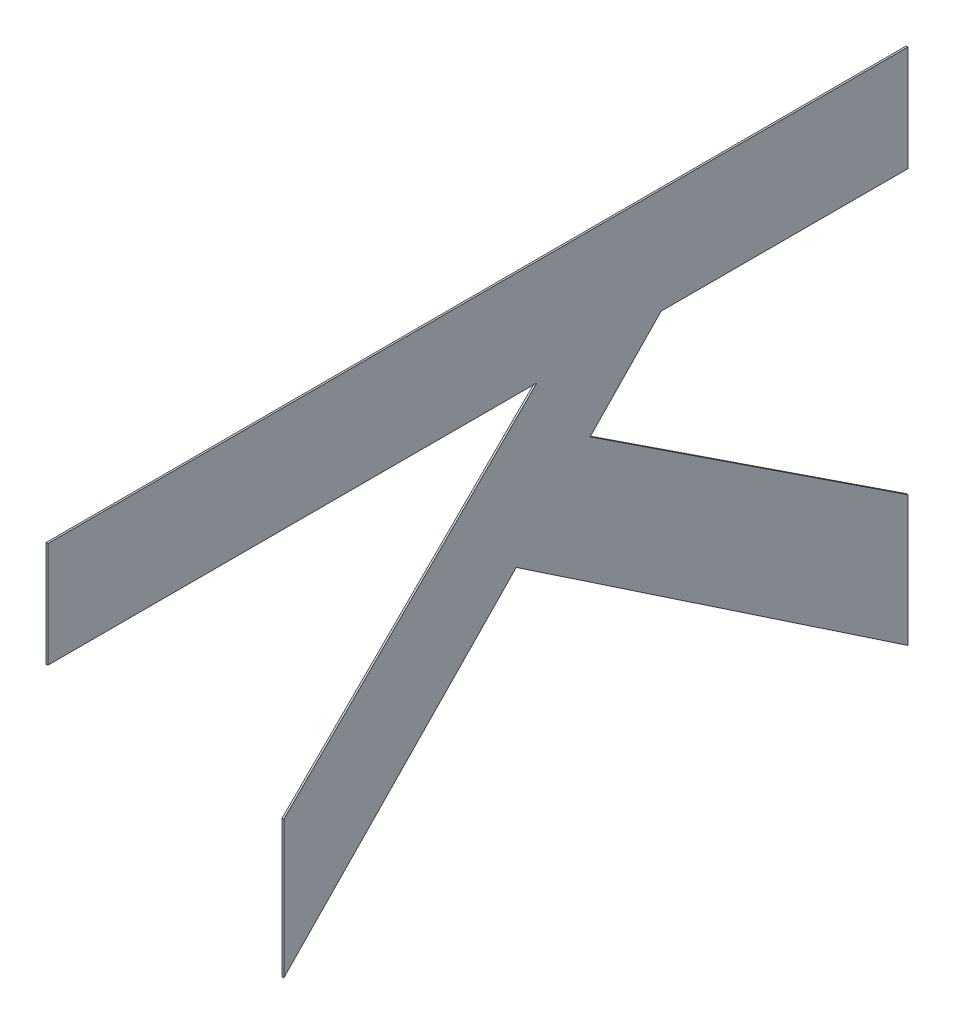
ISO-10303-21;
HEADER;
FILE_DESCRIPTION(('STEP AP214'),'2;1');
FILE_NAME('part.step','',(''),(''),'','','');
FILE_SCHEMA(('AUTOMOTIVE_DESIGN { 1 0 10303 214 1 1 1 1 }'));
ENDSEC;
DATA;
#1=APPLICATION_CONTEXT('core data for automotive mechanical design processes');
#2=APPLICATION_PROTOCOL_DEFINITION('international standard','automotive_design',2000,#1);
#3=PRODUCT_CONTEXT('',#1,'mechanical');
#4=PRODUCT('Part','Part','',(#3));
#5=PRODUCT_RELATED_PRODUCT_CATEGORY('part','',(#4));
#6=PRODUCT_DEFINITION_FORMATION('','',#4);
#7=PRODUCT_DEFINITION_CONTEXT('part definition',#1,'design');
#8=PRODUCT_DEFINITION('design','',#6,#7);
#9=PRODUCT_DEFINITION_SHAPE('','',#8);
#10=(LENGTH_UNIT() NAMED_UNIT(*) SI_UNIT(.MILLI.,.METRE.));
#11=(NAMED_UNIT(*) PLANE_ANGLE_UNIT() SI_UNIT($,.RADIAN.));
#12=(NAMED_UNIT(*) SI_UNIT($,.STERADIAN.) SOLID_ANGLE_UNIT());
#13=UNCERTAINTY_MEASURE_WITH_UNIT(LENGTH_MEASURE(1.E-05),#10,'distance_accuracy_value','');
#14=(GEOMETRIC_REPRESENTATION_CONTEXT(3) GLOBAL_UNCERTAINTY_ASSIGNED_CONTEXT((#13)) GLOBAL_UNIT_ASSIGNED_CONTEXT((#10,
#11,#12)) REPRESENTATION_CONTEXT('',''));
#15=CARTESIAN_POINT('',(0.,0.,0.));
#16=DIRECTION('',(0.,0.,1.));
#17=DIRECTION('',(1.,0.,0.));
#18=AXIS2_PLACEMENT_3D('',#15,#16,#17);
#19=CARTESIAN_POINT('',(-5.56,-7.081189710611,17.19421221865));
#20=DIRECTION('',(-1.,0.,0.));
#21=DIRECTION('',(0.,-1.,0.));
#22=AXIS2_PLACEMENT_3D('',#19,#20,#21);
#23=PLANE('',#22);
#24=DIRECTION('',(0.,1.,0.));
#25=VECTOR('',#24,1.);
#26=CARTESIAN_POINT('',(-5.56,-6.78536977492,22.023794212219));
#27=LINE('',#26,#25);
#28=CARTESIAN_POINT('',(-5.56,-6.78536977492,22.023794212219));
#29=VERTEX_POINT('',#28);
#30=CARTESIAN_POINT('',(-5.56,-7.377009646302,22.023794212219));
#31=VERTEX_POINT('',#30);
#32=EDGE_CURVE('E155',#29,#31,#27,.F.);
#33=ORIENTED_EDGE('',*,*,#32,.F.);
#34=DIRECTION('',(0.,0.,1.));
#35=VECTOR('',#34,1.);
#36=CARTESIAN_POINT('',(-5.56,-6.78536977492,17.19421221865));
#37=LINE('',#36,#35);
#38=CARTESIAN_POINT('',(-5.56,-6.78536977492,17.19421221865));
#39=VERTEX_POINT('',#38);
#40=EDGE_CURVE('E159',#39,#29,#37,.T.);
#41=ORIENTED_EDGE('',*,*,#40,.F.);
#42=DIRECTION('',(0.,-1.,0.));
#43=VECTOR('',#42,1.);
#44=CARTESIAN_POINT('',(-5.56,-7.081189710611,17.19421221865));
#45=LINE('',#44,#43);
#46=CARTESIAN_POINT('',(-5.56,-7.377009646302,17.19421221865));
#47=VERTEX_POINT('',#46);
#48=EDGE_CURVE('E20',#39,#47,#45,.T.);
#49=ORIENTED_EDGE('',*,*,#48,.T.);
#50=DIRECTION('',(0.,0.,1.));
#51=VECTOR('',#50,1.);
#52=CARTESIAN_POINT('',(-5.56,-7.377009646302,18.580064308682));
#53=LINE('',#52,#51);
#54=CARTESIAN_POINT('',(-5.56,-7.37700964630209,18.5800643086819));
#55=VERTEX_POINT('',#54);
#56=EDGE_CURVE('E116',#55,#47,#53,.F.);
#57=ORIENTED_EDGE('',*,*,#56,.F.);
#58=DIRECTION('',(0.,0.718240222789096,-0.695795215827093));
#59=VECTOR('',#58,1.);
#60=CARTESIAN_POINT('',(-5.56,-7.788585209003,18.978778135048));
#61=LINE('',#60,#59);
#62=CARTESIAN_POINT('',(-5.56,-7.7885852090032,18.9787781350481));
#63=VERTEX_POINT('',#62);
#64=EDGE_CURVE('E107',#63,#55,#61,.T.);
#65=ORIENTED_EDGE('',*,*,#64,.F.);
#66=DIRECTION('',(0.,0.549478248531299,0.835508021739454));
#67=VECTOR('',#66,1.);
#68=CARTESIAN_POINT('',(-5.56,-8.962218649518,17.19421221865));
#69=LINE('',#68,#67);
#70=CARTESIAN_POINT('',(-5.56,-8.962218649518,17.19421221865));
#71=VERTEX_POINT('',#70);
#72=EDGE_CURVE('E102',#71,#63,#69,.T.);
#73=ORIENTED_EDGE('',*,*,#72,.F.);
#74=DIRECTION('',(0.,1.,0.));
#75=VECTOR('',#74,1.);
#76=CARTESIAN_POINT('',(-5.56,-9.695337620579,17.19421221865));
#77=LINE('',#76,#75);
#78=CARTESIAN_POINT('',(-5.56,-9.6953376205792,17.1942122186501));
#79=VERTEX_POINT('',#78);
#80=EDGE_CURVE('E131',#79,#71,#77,.T.);
#81=ORIENTED_EDGE('',*,*,#80,.F.);
#82=DIRECTION('',(0.,-0.558055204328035,-0.829803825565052));
#83=VECTOR('',#82,1.);
#84=CARTESIAN_POINT('',(-5.56,-8.216237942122,19.393569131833));
#85=LINE('',#84,#83);
#86=CARTESIAN_POINT('',(-5.56,-8.21623794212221,19.3935691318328));
#87=VERTEX_POINT('',#86);
#88=EDGE_CURVE('E135',#87,#79,#85,.T.);
#89=ORIENTED_EDGE('',*,*,#88,.F.);
#90=DIRECTION('',(0.,0.717328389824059,-0.696735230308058));
#91=VECTOR('',#90,1.);
#92=CARTESIAN_POINT('',(-5.56,-9.560289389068,20.699035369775));
#93=LINE('',#92,#91);
#94=CARTESIAN_POINT('',(-5.56,-9.560289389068,20.699035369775));
#95=VERTEX_POINT('',#94);
#96=EDGE_CURVE('E139',#95,#87,#93,.T.);
#97=ORIENTED_EDGE('',*,*,#96,.F.);
#98=DIRECTION('',(0.,1.,0.));
#99=VECTOR('',#98,1.);
#100=CARTESIAN_POINT('',(-5.56,-8.788585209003,20.699035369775));
#101=LINE('',#100,#99);
#102=CARTESIAN_POINT('',(-5.56,-8.788585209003,20.699035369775));
#103=VERTEX_POINT('',#102);
#104=EDGE_CURVE('E143',#103,#95,#101,.F.);
#105=ORIENTED_EDGE('',*,*,#104,.F.);
#106=DIRECTION('',(0.,-0.704694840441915,0.709510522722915));
#107=VECTOR('',#106,1.);
#108=CARTESIAN_POINT('',(-5.56,-7.377009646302,19.277813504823));
#109=LINE('',#108,#107);
#110=CARTESIAN_POINT('',(-5.56,-7.377009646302,19.277813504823));
#111=VERTEX_POINT('',#110);
#112=EDGE_CURVE('E147',#111,#103,#109,.T.);
#113=ORIENTED_EDGE('',*,*,#112,.F.);
#114=DIRECTION('',(0.,0.,1.));
#115=VECTOR('',#114,1.);
#116=CARTESIAN_POINT('',(-5.56,-7.377009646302,22.023794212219));
#117=LINE('',#116,#115);
#118=EDGE_CURVE('E151',#31,#111,#117,.F.);
#119=ORIENTED_EDGE('',*,*,#118,.F.);
#120=EDGE_LOOP('',(#33,#41,#49,#57,#65,#73,#81,#89,#97,#105,#113,#119));
#121=FACE_BOUND('',#120,.T.);
#122=ADVANCED_FACE('F17',(#121),#23,.T.);
#123=CARTESIAN_POINT('',(-5.56,-7.377009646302,18.580064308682));
#124=DIRECTION('',(0.,-1.,0.));
#125=DIRECTION('',(1.,0.,0.));
#126=AXIS2_PLACEMENT_3D('',#123,#124,#125);
#127=PLANE('',#126);
#128=ORIENTED_EDGE('',*,*,#56,.T.);
#129=DIRECTION('',(-1.,0.,0.));
#130=VECTOR('',#129,1.);
#131=CARTESIAN_POINT('',(-5.56,-7.377009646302,17.19421221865));
#132=LINE('',#131,#130);
#133=CARTESIAN_POINT('',(-5.55,-7.377009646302,17.19421221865));
#134=VERTEX_POINT('',#133);
#135=EDGE_CURVE('E163',#134,#47,#132,.T.);
#136=ORIENTED_EDGE('',*,*,#135,.F.);
#137=DIRECTION('',(0.,0.,1.));
#138=VECTOR('',#137,1.);
#139=CARTESIAN_POINT('',(-5.55,-7.377009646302,17.19421221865));
#140=LINE('',#139,#138);
#141=CARTESIAN_POINT('',(-5.55,-7.37700964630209,18.5800643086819));
#142=VERTEX_POINT('',#141);
#143=EDGE_CURVE('E126',#134,#142,#140,.T.);
#144=ORIENTED_EDGE('',*,*,#143,.T.);
#145=DIRECTION('',(1.,0.,0.));
#146=VECTOR('',#145,1.);
#147=CARTESIAN_POINT('',(-5.56,-7.37700964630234,18.5800643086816));
#148=LINE('',#147,#146);
#149=EDGE_CURVE('E112',#55,#142,#148,.T.);
#150=ORIENTED_EDGE('',*,*,#149,.F.);
#151=EDGE_LOOP('',(#128,#136,#144,#150));
#152=FACE_BOUND('',#151,.T.);
#153=ADVANCED_FACE('F125',(#152),#127,.T.);
#154=CARTESIAN_POINT('',(-5.56,-7.788585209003,18.978778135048));
#155=DIRECTION('',(0.,-0.695795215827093,-0.718240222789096));
#156=DIRECTION('',(0.,0.718240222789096,-0.695795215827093));
#157=AXIS2_PLACEMENT_3D('',#154,#155,#156);
#158=PLANE('',#157);
#159=ORIENTED_EDGE('',*,*,#64,.T.);
#160=ORIENTED_EDGE('',*,*,#149,.T.);
#161=DIRECTION('',(0.,-0.718240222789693,0.695795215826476));
#162=VECTOR('',#161,1.);
#163=CARTESIAN_POINT('',(-5.55,-7.377009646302,18.580064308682));
#164=LINE('',#163,#162);
#165=CARTESIAN_POINT('',(-5.55,-7.7885852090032,18.9787781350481));
#166=VERTEX_POINT('',#165);
#167=EDGE_CURVE('E167',#142,#166,#164,.T.);
#168=ORIENTED_EDGE('',*,*,#167,.T.);
#169=DIRECTION('',(1.,0.,0.));
#170=VECTOR('',#169,1.);
#171=CARTESIAN_POINT('',(-5.56,-7.78858520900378,18.9787781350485));
#172=LINE('',#171,#170);
#173=EDGE_CURVE('E114',#63,#166,#172,.T.);
#174=ORIENTED_EDGE('',*,*,#173,.F.);
#175=EDGE_LOOP('',(#159,#160,#168,#174));
#176=FACE_BOUND('',#175,.T.);
#177=ADVANCED_FACE('F109',(#176),#158,.T.);
#178=CARTESIAN_POINT('',(-5.56,-8.962218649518,17.19421221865));
#179=DIRECTION('',(0.,0.835508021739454,-0.549478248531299));
#180=DIRECTION('',(0.,0.549478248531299,0.835508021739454));
#181=AXIS2_PLACEMENT_3D('',#178,#179,#180);
#182=PLANE('',#181);
#183=ORIENTED_EDGE('',*,*,#72,.T.);
#184=ORIENTED_EDGE('',*,*,#173,.T.);
#185=DIRECTION('',(0.,-0.549478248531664,-0.835508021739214));
#186=VECTOR('',#185,1.);
#187=CARTESIAN_POINT('',(-5.55,-7.788585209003,18.978778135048));
#188=LINE('',#187,#186);
#189=CARTESIAN_POINT('',(-5.55,-8.962218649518,17.19421221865));
#190=VERTEX_POINT('',#189);
#191=EDGE_CURVE('E169',#166,#190,#188,.T.);
#192=ORIENTED_EDGE('',*,*,#191,.T.);
#193=DIRECTION('',(-1.,0.,0.));
#194=VECTOR('',#193,1.);
#195=CARTESIAN_POINT('',(-5.56,-8.962218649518,17.19421221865));
#196=LINE('',#195,#194);
#197=EDGE_CURVE('E133',#71,#190,#196,.F.);
#198=ORIENTED_EDGE('',*,*,#197,.F.);
#199=EDGE_LOOP('',(#183,#184,#192,#198));
#200=FACE_BOUND('',#199,.T.);
#201=ADVANCED_FACE('F234',(#200),#182,.T.);
#202=CARTESIAN_POINT('',(-5.56,-9.695337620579,17.19421221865));
#203=DIRECTION('',(0.,0.,-1.));
#204=DIRECTION('',(-1.,0.,0.));
#205=AXIS2_PLACEMENT_3D('',#202,#203,#204);
#206=PLANE('',#205);
#207=ORIENTED_EDGE('',*,*,#80,.T.);
#208=ORIENTED_EDGE('',*,*,#197,.T.);
#209=DIRECTION('',(0.,-1.,0.));
#210=VECTOR('',#209,1.);
#211=CARTESIAN_POINT('',(-5.55,-7.081189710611,17.19421221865));
#212=LINE('',#211,#210);
#213=CARTESIAN_POINT('',(-5.55,-9.6953376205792,17.1942122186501));
#214=VERTEX_POINT('',#213);
#215=EDGE_CURVE('E172',#190,#214,#212,.T.);
#216=ORIENTED_EDGE('',*,*,#215,.T.);
#217=DIRECTION('',(1.,0.,0.));
#218=VECTOR('',#217,1.);
#219=CARTESIAN_POINT('',(-5.56,-9.6953376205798,17.1942122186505));
#220=LINE('',#219,#218);
#221=EDGE_CURVE('E137',#79,#214,#220,.T.);
#222=ORIENTED_EDGE('',*,*,#221,.F.);
#223=EDGE_LOOP('',(#207,#208,#216,#222));
#224=FACE_BOUND('',#223,.T.);
#225=ADVANCED_FACE('F233',(#224),#206,.T.);
#226=CARTESIAN_POINT('',(-5.56,-8.216237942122,19.393569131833));
#227=DIRECTION('',(0.,-0.829803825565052,0.558055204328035));
#228=DIRECTION('',(0.,-0.558055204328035,-0.829803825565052));
#229=AXIS2_PLACEMENT_3D('',#226,#227,#228);
#230=PLANE('',#229);
#231=ORIENTED_EDGE('',*,*,#88,.T.);
#232=ORIENTED_EDGE('',*,*,#221,.T.);
#233=DIRECTION('',(0.,0.558055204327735,0.829803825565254));
#234=VECTOR('',#233,1.);
#235=CARTESIAN_POINT('',(-5.55,-9.695337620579,17.19421221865));
#236=LINE('',#235,#234);
#237=CARTESIAN_POINT('',(-5.55,-8.21623794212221,19.3935691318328));
#238=VERTEX_POINT('',#237);
#239=EDGE_CURVE('E175',#214,#238,#236,.T.);
#240=ORIENTED_EDGE('',*,*,#239,.T.);
#241=DIRECTION('',(1.,0.,0.));
#242=VECTOR('',#241,1.);
#243=CARTESIAN_POINT('',(-5.56,-8.21623794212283,19.3935691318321));
#244=LINE('',#243,#242);
#245=EDGE_CURVE('E141',#87,#238,#244,.T.);
#246=ORIENTED_EDGE('',*,*,#245,.F.);
#247=EDGE_LOOP('',(#231,#232,#240,#246));
#248=FACE_BOUND('',#247,.T.);
#249=ADVANCED_FACE('F227',(#248),#230,.T.);
#250=CARTESIAN_POINT('',(-5.56,-9.560289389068,20.699035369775));
#251=DIRECTION('',(0.,-0.696735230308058,-0.717328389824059));
#252=DIRECTION('',(0.,0.717328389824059,-0.696735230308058));
#253=AXIS2_PLACEMENT_3D('',#250,#251,#252);
#254=PLANE('',#253);
#255=ORIENTED_EDGE('',*,*,#96,.T.);
#256=ORIENTED_EDGE('',*,*,#245,.T.);
#257=DIRECTION('',(0.,-0.717328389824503,0.696735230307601));
#258=VECTOR('',#257,1.);
#259=CARTESIAN_POINT('',(-5.55,-8.216237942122,19.393569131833));
#260=LINE('',#259,#258);
#261=CARTESIAN_POINT('',(-5.55,-9.560289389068,20.699035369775));
#262=VERTEX_POINT('',#261);
#263=EDGE_CURVE('E178',#238,#262,#260,.T.);
#264=ORIENTED_EDGE('',*,*,#263,.T.);
#265=DIRECTION('',(1.,0.,0.));
#266=VECTOR('',#265,1.);
#267=CARTESIAN_POINT('',(-5.56,-9.560289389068,20.699035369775));
#268=LINE('',#267,#266);
#269=EDGE_CURVE('E145',#95,#262,#268,.T.);
#270=ORIENTED_EDGE('',*,*,#269,.F.);
#271=EDGE_LOOP('',(#255,#256,#264,#270));
#272=FACE_BOUND('',#271,.T.);
#273=ADVANCED_FACE('F223',(#272),#254,.T.);
#274=CARTESIAN_POINT('',(-5.56,-8.788585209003,20.699035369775));
#275=DIRECTION('',(0.,0.,1.));
#276=DIRECTION('',(1.,0.,0.));
#277=AXIS2_PLACEMENT_3D('',#274,#275,#276);
#278=PLANE('',#277);
#279=ORIENTED_EDGE('',*,*,#104,.T.);
#280=ORIENTED_EDGE('',*,*,#269,.T.);
#281=DIRECTION('',(0.,-1.,0.));
#282=VECTOR('',#281,1.);
#283=CARTESIAN_POINT('',(-5.55,-7.081189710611,20.699035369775));
#284=LINE('',#283,#282);
#285=CARTESIAN_POINT('',(-5.55,-8.788585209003,20.699035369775));
#286=VERTEX_POINT('',#285);
#287=EDGE_CURVE('E181',#262,#286,#284,.F.);
#288=ORIENTED_EDGE('',*,*,#287,.T.);
#289=DIRECTION('',(1.,0.,0.));
#290=VECTOR('',#289,1.);
#291=CARTESIAN_POINT('',(-5.56,-8.78858520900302,20.699035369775));
#292=LINE('',#291,#290);
#293=EDGE_CURVE('E149',#103,#286,#292,.T.);
#294=ORIENTED_EDGE('',*,*,#293,.F.);
#295=EDGE_LOOP('',(#279,#280,#288,#294));
#296=FACE_BOUND('',#295,.T.);
#297=ADVANCED_FACE('F217',(#296),#278,.T.);
#298=CARTESIAN_POINT('',(-5.56,-7.377009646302,19.277813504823));
#299=DIRECTION('',(0.,0.709510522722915,0.704694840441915));
#300=DIRECTION('',(0.,-0.704694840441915,0.709510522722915));
#301=AXIS2_PLACEMENT_3D('',#298,#299,#300);
#302=PLANE('',#301);
#303=ORIENTED_EDGE('',*,*,#112,.T.);
#304=ORIENTED_EDGE('',*,*,#293,.T.);
#305=DIRECTION('',(0.,0.704694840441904,-0.709510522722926));
#306=VECTOR('',#305,1.);
#307=CARTESIAN_POINT('',(-5.55,-8.788585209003,20.699035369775));
#308=LINE('',#307,#306);
#309=CARTESIAN_POINT('',(-5.55,-7.377009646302,19.277813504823));
#310=VERTEX_POINT('',#309);
#311=EDGE_CURVE('E184',#286,#310,#308,.T.);
#312=ORIENTED_EDGE('',*,*,#311,.T.);
#313=DIRECTION('',(1.,0.,0.));
#314=VECTOR('',#313,1.);
#315=CARTESIAN_POINT('',(-5.56,-7.377009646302,19.277813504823));
#316=LINE('',#315,#314);
#317=EDGE_CURVE('E153',#111,#310,#316,.T.);
#318=ORIENTED_EDGE('',*,*,#317,.F.);
#319=EDGE_LOOP('',(#303,#304,#312,#318));
#320=FACE_BOUND('',#319,.T.);
#321=ADVANCED_FACE('F213',(#320),#302,.T.);
#322=CARTESIAN_POINT('',(-5.56,-7.377009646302,22.023794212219));
#323=DIRECTION('',(0.,-1.,0.));
#324=DIRECTION('',(1.,0.,0.));
#325=AXIS2_PLACEMENT_3D('',#322,#323,#324);
#326=PLANE('',#325);
#327=ORIENTED_EDGE('',*,*,#118,.T.);
#328=ORIENTED_EDGE('',*,*,#317,.T.);
#329=DIRECTION('',(0.,0.,1.));
#330=VECTOR('',#329,1.);
#331=CARTESIAN_POINT('',(-5.55,-7.377009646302,17.19421221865));
#332=LINE('',#331,#330);
#333=CARTESIAN_POINT('',(-5.55,-7.377009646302,22.023794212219));
#334=VERTEX_POINT('',#333);
#335=EDGE_CURVE('E187',#310,#334,#332,.T.);
#336=ORIENTED_EDGE('',*,*,#335,.T.);
#337=DIRECTION('',(1.,0.,0.));
#338=VECTOR('',#337,1.);
#339=CARTESIAN_POINT('',(-5.56,-7.377009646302,22.023794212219));
#340=LINE('',#339,#338);
#341=EDGE_CURVE('E157',#31,#334,#340,.T.);
#342=ORIENTED_EDGE('',*,*,#341,.F.);
#343=EDGE_LOOP('',(#327,#328,#336,#342));
#344=FACE_BOUND('',#343,.T.);
#345=ADVANCED_FACE('F207',(#344),#326,.T.);
#346=CARTESIAN_POINT('',(-5.56,-6.78536977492,22.023794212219));
#347=DIRECTION('',(0.,0.,1.));
#348=DIRECTION('',(1.,0.,0.));
#349=AXIS2_PLACEMENT_3D('',#346,#347,#348);
#350=PLANE('',#349);
#351=ORIENTED_EDGE('',*,*,#32,.T.);
#352=ORIENTED_EDGE('',*,*,#341,.T.);
#353=DIRECTION('',(0.,-1.,0.));
#354=VECTOR('',#353,1.);
#355=CARTESIAN_POINT('',(-5.55,-7.081189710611,22.023794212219));
#356=LINE('',#355,#354);
#357=CARTESIAN_POINT('',(-5.55,-6.78536977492,22.023794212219));
#358=VERTEX_POINT('',#357);
#359=EDGE_CURVE('E190',#334,#358,#356,.F.);
#360=ORIENTED_EDGE('',*,*,#359,.T.);
#361=DIRECTION('',(-1.,0.,0.));
#362=VECTOR('',#361,1.);
#363=CARTESIAN_POINT('',(-5.56,-6.78536977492,22.023794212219));
#364=LINE('',#363,#362);
#365=EDGE_CURVE('E161',#29,#358,#364,.F.);
#366=ORIENTED_EDGE('',*,*,#365,.F.);
#367=EDGE_LOOP('',(#351,#352,#360,#366));
#368=FACE_BOUND('',#367,.T.);
#369=ADVANCED_FACE('F203',(#368),#350,.T.);
#370=CARTESIAN_POINT('',(-5.56,-6.78536977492,17.19421221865));
#371=DIRECTION('',(0.,1.,0.));
#372=DIRECTION('',(-1.,0.,0.));
#373=AXIS2_PLACEMENT_3D('',#370,#371,#372);
#374=PLANE('',#373);
#375=ORIENTED_EDGE('',*,*,#40,.T.);
#376=ORIENTED_EDGE('',*,*,#365,.T.);
#377=DIRECTION('',(0.,0.,1.));
#378=VECTOR('',#377,1.);
#379=CARTESIAN_POINT('',(-5.55,-6.78536977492,17.19421221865));
#380=LINE('',#379,#378);
#381=CARTESIAN_POINT('',(-5.55,-6.78536977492,17.19421221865));
#382=VERTEX_POINT('',#381);
#383=EDGE_CURVE('E26',#358,#382,#380,.F.);
#384=ORIENTED_EDGE('',*,*,#383,.T.);
#385=DIRECTION('',(-1.,0.,0.));
#386=VECTOR('',#385,1.);
#387=CARTESIAN_POINT('',(-5.56,-6.78536977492,17.19421221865));
#388=LINE('',#387,#386);
#389=EDGE_CURVE('E34',#39,#382,#388,.F.);
#390=ORIENTED_EDGE('',*,*,#389,.F.);
#391=EDGE_LOOP('',(#375,#376,#384,#390));
#392=FACE_BOUND('',#391,.T.);
#393=ADVANCED_FACE('F196',(#392),#374,.T.);
#394=CARTESIAN_POINT('',(-5.56,-7.377009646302,17.19421221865));
#395=DIRECTION('',(0.,0.,-1.));
#396=DIRECTION('',(-1.,0.,0.));
#397=AXIS2_PLACEMENT_3D('',#394,#395,#396);
#398=PLANE('',#397);
#399=ORIENTED_EDGE('',*,*,#48,.F.);
#400=ORIENTED_EDGE('',*,*,#389,.T.);
#401=DIRECTION('',(0.,-1.,0.));
#402=VECTOR('',#401,1.);
#403=CARTESIAN_POINT('',(-5.55,-7.081189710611,17.19421221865));
#404=LINE('',#403,#402);
#405=EDGE_CURVE('E11',#382,#134,#404,.T.);
#406=ORIENTED_EDGE('',*,*,#405,.T.);
#407=ORIENTED_EDGE('',*,*,#135,.T.);
#408=EDGE_LOOP('',(#399,#400,#406,#407));
#409=FACE_BOUND('',#408,.T.);
#410=ADVANCED_FACE('F235',(#409),#398,.T.);
#411=CARTESIAN_POINT('',(-5.55,-7.081189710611,17.19421221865));
#412=DIRECTION('',(-1.,0.,0.));
#413=DIRECTION('',(0.,-1.,0.));
#414=AXIS2_PLACEMENT_3D('',#411,#412,#413);
#415=PLANE('',#414);
#416=ORIENTED_EDGE('',*,*,#383,.F.);
#417=ORIENTED_EDGE('',*,*,#359,.F.);
#418=ORIENTED_EDGE('',*,*,#335,.F.);
#419=ORIENTED_EDGE('',*,*,#311,.F.);
#420=ORIENTED_EDGE('',*,*,#287,.F.);
#421=ORIENTED_EDGE('',*,*,#263,.F.);
#422=ORIENTED_EDGE('',*,*,#239,.F.);
#423=ORIENTED_EDGE('',*,*,#215,.F.);
#424=ORIENTED_EDGE('',*,*,#191,.F.);
#425=ORIENTED_EDGE('',*,*,#167,.F.);
#426=ORIENTED_EDGE('',*,*,#143,.F.);
#427=ORIENTED_EDGE('',*,*,#405,.F.);
#428=EDGE_LOOP('',(#416,#417,#418,#419,#420,#421,#422,#423,#424,#425,#426,#427));
#429=FACE_BOUND('',#428,.T.);
#430=ADVANCED_FACE('F200',(#429),#415,.F.);
#431=CLOSED_SHELL('',(#122,#153,#177,#201,#225,#249,#273,#297,#321,#345,#369,#393,#410,#430));
#432=MANIFOLD_SOLID_BREP('B1',#431);
#433=ADVANCED_BREP_SHAPE_REPRESENTATION('',(#18,#432),#14);
#434=SHAPE_DEFINITION_REPRESENTATION(#9,#433);
ENDSEC;
END-ISO-10303-21;
